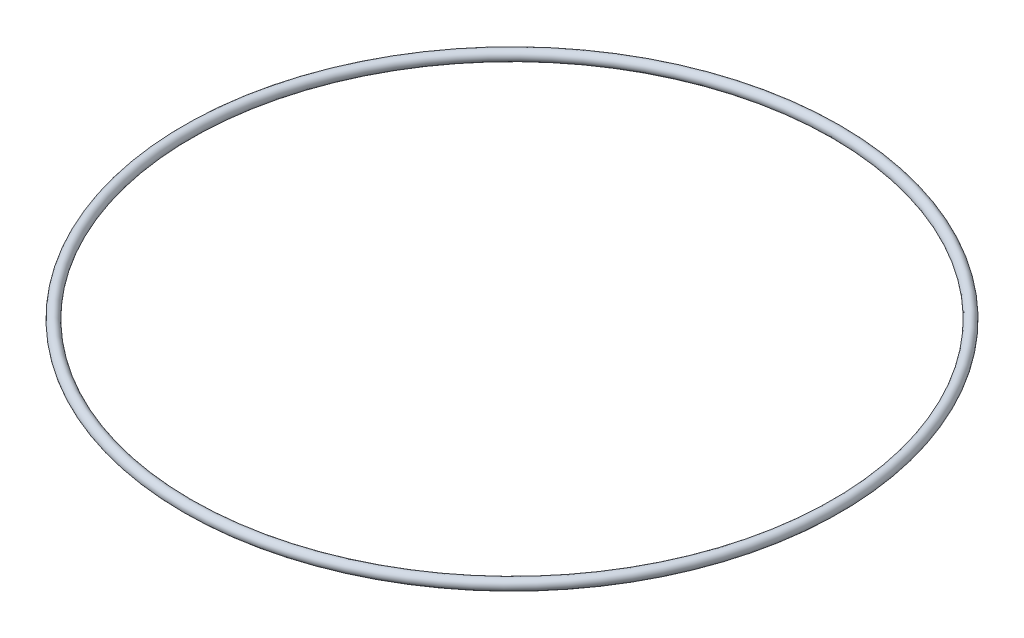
from build123d import *

# Parameters (mm, degrees)
ESQUISSE1_R = 1.5


with BuildPart() as part:
    # Esquisse1 → Base-R_volution (revolve)
    with BuildSketch(Plane.XY, mode=Mode.PRIVATE) as base_r_volution_sk:
        with Locations((92.5, 0)):
            Circle(ESQUISSE1_R)
    revolve(base_r_volution_sk.sketch.rotate(Axis((0, 1.5, 0), (0, -1, 0)), 90), axis=Axis((0, 1.5, 0), (0, -1, 0)))


solid = part.part
